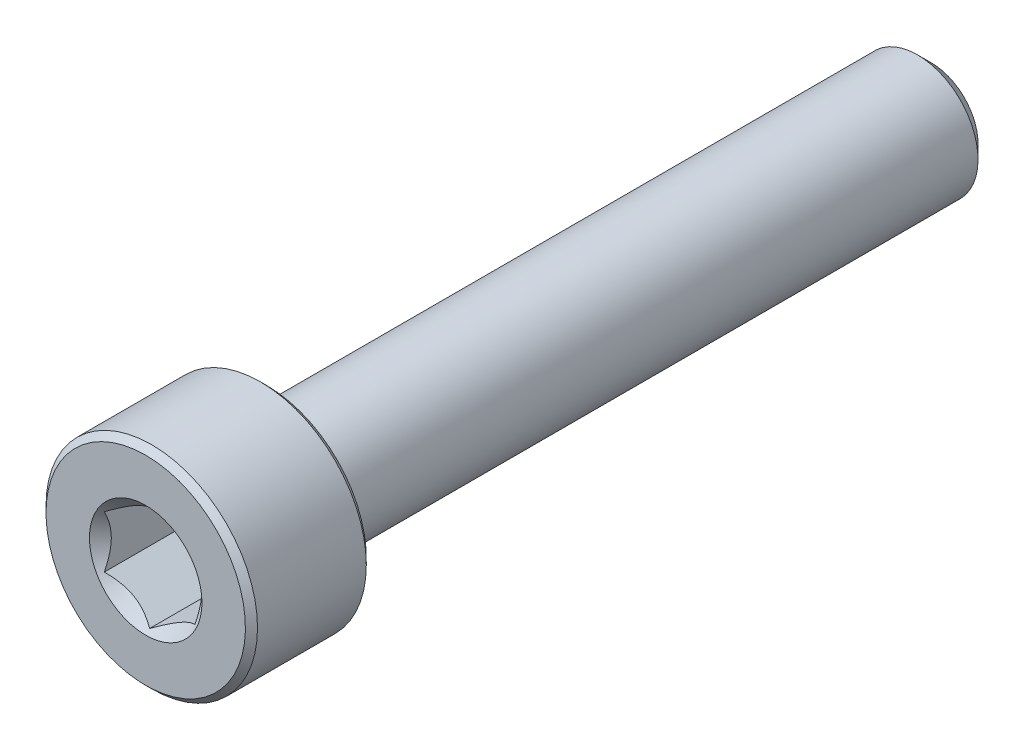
ISO-10303-21;
HEADER;
FILE_DESCRIPTION(('STEP AP214'),'2;1');
FILE_NAME('part.step','',(''),(''),'','','');
FILE_SCHEMA(('AUTOMOTIVE_DESIGN { 1 0 10303 214 1 1 1 1 }'));
ENDSEC;
DATA;
#1=APPLICATION_CONTEXT('core data for automotive mechanical design processes');
#2=APPLICATION_PROTOCOL_DEFINITION('international standard','automotive_design',2000,#1);
#3=PRODUCT_CONTEXT('',#1,'mechanical');
#4=PRODUCT('Part','Part','',(#3));
#5=PRODUCT_RELATED_PRODUCT_CATEGORY('part','',(#4));
#6=PRODUCT_DEFINITION_FORMATION('','',#4);
#7=PRODUCT_DEFINITION_CONTEXT('part definition',#1,'design');
#8=PRODUCT_DEFINITION('design','',#6,#7);
#9=PRODUCT_DEFINITION_SHAPE('','',#8);
#10=(LENGTH_UNIT() NAMED_UNIT(*) SI_UNIT(.MILLI.,.METRE.));
#11=(NAMED_UNIT(*) PLANE_ANGLE_UNIT() SI_UNIT($,.RADIAN.));
#12=(NAMED_UNIT(*) SI_UNIT($,.STERADIAN.) SOLID_ANGLE_UNIT());
#13=UNCERTAINTY_MEASURE_WITH_UNIT(LENGTH_MEASURE(1.E-05),#10,'distance_accuracy_value','');
#14=(GEOMETRIC_REPRESENTATION_CONTEXT(3) GLOBAL_UNCERTAINTY_ASSIGNED_CONTEXT((#13)) GLOBAL_UNIT_ASSIGNED_CONTEXT((#10,
#11,#12)) REPRESENTATION_CONTEXT('',''));
#15=CARTESIAN_POINT('',(0.,0.,0.));
#16=DIRECTION('',(0.,0.,1.));
#17=DIRECTION('',(1.,0.,0.));
#18=AXIS2_PLACEMENT_3D('',#15,#16,#17);
#19=CARTESIAN_POINT('',(0.,1.54533666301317,-13.));
#20=DIRECTION('',(0.,0.,-1.));
#21=DIRECTION('',(0.,1.,0.));
#22=AXIS2_PLACEMENT_3D('',#19,#20,#21);
#23=PLANE('',#22);
#24=CARTESIAN_POINT('',(0.,0.,-13.));
#25=DIRECTION('',(0.,0.,-1.));
#26=DIRECTION('',(0.,1.,0.));
#27=AXIS2_PLACEMENT_3D('',#24,#25,#26);
#28=CIRCLE('',#27,1.54533666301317);
#29=CARTESIAN_POINT('',(0.,1.54533666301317,-13.));
#30=VERTEX_POINT('',#29);
#31=EDGE_CURVE('E48',#30,#30,#28,.T.);
#32=ORIENTED_EDGE('',*,*,#31,.T.);
#33=EDGE_LOOP('',(#32));
#34=FACE_BOUND('',#33,.T.);
#35=ADVANCED_FACE('F35',(#34),#23,.T.);
#36=CARTESIAN_POINT('',(0.,0.,-13.));
#37=DIRECTION('',(0.,0.,1.));
#38=DIRECTION('',(0.,-1.,0.));
#39=AXIS2_PLACEMENT_3D('',#36,#37,#38);
#40=CONICAL_SURFACE('',#39,1.54533666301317,0.785398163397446);
#41=CARTESIAN_POINT('',(0.,0.,-12.5453366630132));
#42=DIRECTION('',(0.,0.,-1.));
#43=DIRECTION('',(0.,1.,0.));
#44=AXIS2_PLACEMENT_3D('',#41,#42,#43);
#45=CIRCLE('',#44,2.);
#46=CARTESIAN_POINT('',(0.,2.,-12.5453366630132));
#47=VERTEX_POINT('',#46);
#48=EDGE_CURVE('E151',#47,#47,#45,.T.);
#49=ORIENTED_EDGE('',*,*,#48,.T.);
#50=EDGE_LOOP('',(#49));
#51=FACE_BOUND('',#50,.T.);
#52=ORIENTED_EDGE('',*,*,#31,.F.);
#53=EDGE_LOOP('',(#52));
#54=FACE_BOUND('',#53,.T.);
#55=ADVANCED_FACE('F157',(#51,#54),#40,.T.);
#56=CARTESIAN_POINT('',(0.,0.,-13.));
#57=DIRECTION('',(0.,0.,-1.));
#58=DIRECTION('',(0.,1.,0.));
#59=AXIS2_PLACEMENT_3D('',#56,#57,#58);
#60=CYLINDRICAL_SURFACE('',#59,2.);
#61=CARTESIAN_POINT('',(0.,0.,8.8));
#62=DIRECTION('',(0.,0.,-1.));
#63=DIRECTION('',(0.,1.,0.));
#64=AXIS2_PLACEMENT_3D('',#61,#62,#63);
#65=CIRCLE('',#64,2.);
#66=CARTESIAN_POINT('',(0.,2.,8.8));
#67=VERTEX_POINT('',#66);
#68=EDGE_CURVE('E148',#67,#67,#65,.T.);
#69=ORIENTED_EDGE('',*,*,#68,.T.);
#70=EDGE_LOOP('',(#69));
#71=FACE_BOUND('',#70,.T.);
#72=ORIENTED_EDGE('',*,*,#48,.F.);
#73=EDGE_LOOP('',(#72));
#74=FACE_BOUND('',#73,.T.);
#75=ADVANCED_FACE('F159',(#71,#74),#60,.T.);
#76=CARTESIAN_POINT('',(0.,0.,8.8));
#77=DIRECTION('',(0.,0.,-1.));
#78=DIRECTION('',(0.,1.,0.));
#79=AXIS2_PLACEMENT_3D('',#76,#77,#78);
#80=TOROIDAL_SURFACE('',#79,2.2,0.200000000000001);
#81=CARTESIAN_POINT('',(0.,0.,9.));
#82=DIRECTION('',(0.,0.,-1.));
#83=DIRECTION('',(0.,1.,0.));
#84=AXIS2_PLACEMENT_3D('',#81,#82,#83);
#85=CIRCLE('',#84,2.2);
#86=CARTESIAN_POINT('',(0.,2.2,9.));
#87=VERTEX_POINT('',#86);
#88=EDGE_CURVE('E145',#87,#87,#85,.T.);
#89=ORIENTED_EDGE('',*,*,#88,.T.);
#90=EDGE_LOOP('',(#89));
#91=FACE_BOUND('',#90,.T.);
#92=ORIENTED_EDGE('',*,*,#68,.F.);
#93=EDGE_LOOP('',(#92));
#94=FACE_BOUND('',#93,.T.);
#95=ADVANCED_FACE('F165',(#91,#94),#80,.F.);
#96=CARTESIAN_POINT('',(0.,3.3,9.));
#97=DIRECTION('',(0.,0.,-1.));
#98=DIRECTION('',(0.,1.,0.));
#99=AXIS2_PLACEMENT_3D('',#96,#97,#98);
#100=PLANE('',#99);
#101=CARTESIAN_POINT('',(0.,0.,9.));
#102=DIRECTION('',(0.,0.,-1.));
#103=DIRECTION('',(0.,1.,0.));
#104=AXIS2_PLACEMENT_3D('',#101,#102,#103);
#105=CIRCLE('',#104,3.3);
#106=CARTESIAN_POINT('',(0.,3.3,9.));
#107=VERTEX_POINT('',#106);
#108=EDGE_CURVE('E142',#107,#107,#105,.T.);
#109=ORIENTED_EDGE('',*,*,#108,.T.);
#110=EDGE_LOOP('',(#109));
#111=FACE_BOUND('',#110,.T.);
#112=ORIENTED_EDGE('',*,*,#88,.F.);
#113=EDGE_LOOP('',(#112));
#114=FACE_BOUND('',#113,.T.);
#115=ADVANCED_FACE('F171',(#111,#114),#100,.T.);
#116=CARTESIAN_POINT('',(0.,0.,9.));
#117=DIRECTION('',(0.,0.,1.));
#118=DIRECTION('',(0.,-1.,0.));
#119=AXIS2_PLACEMENT_3D('',#116,#117,#118);
#120=CONICAL_SURFACE('',#119,3.3,0.785398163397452);
#121=CARTESIAN_POINT('',(0.,0.,9.2));
#122=DIRECTION('',(0.,0.,-1.));
#123=DIRECTION('',(0.,1.,0.));
#124=AXIS2_PLACEMENT_3D('',#121,#122,#123);
#125=CIRCLE('',#124,3.5);
#126=CARTESIAN_POINT('',(0.,3.5,9.2));
#127=VERTEX_POINT('',#126);
#128=EDGE_CURVE('E139',#127,#127,#125,.T.);
#129=ORIENTED_EDGE('',*,*,#128,.T.);
#130=EDGE_LOOP('',(#129));
#131=FACE_BOUND('',#130,.T.);
#132=ORIENTED_EDGE('',*,*,#108,.F.);
#133=EDGE_LOOP('',(#132));
#134=FACE_BOUND('',#133,.T.);
#135=ADVANCED_FACE('F175',(#131,#134),#120,.T.);
#136=CARTESIAN_POINT('',(0.,0.,-13.));
#137=DIRECTION('',(0.,0.,-1.));
#138=DIRECTION('',(0.,1.,0.));
#139=AXIS2_PLACEMENT_3D('',#136,#137,#138);
#140=CYLINDRICAL_SURFACE('',#139,3.5);
#141=CARTESIAN_POINT('',(0.,0.,12.8));
#142=DIRECTION('',(0.,0.,-1.));
#143=DIRECTION('',(0.,1.,0.));
#144=AXIS2_PLACEMENT_3D('',#141,#142,#143);
#145=CIRCLE('',#144,3.5);
#146=CARTESIAN_POINT('',(0.,3.5,12.8));
#147=VERTEX_POINT('',#146);
#148=EDGE_CURVE('E136',#147,#147,#145,.T.);
#149=ORIENTED_EDGE('',*,*,#148,.T.);
#150=EDGE_LOOP('',(#149));
#151=FACE_BOUND('',#150,.T.);
#152=ORIENTED_EDGE('',*,*,#128,.F.);
#153=EDGE_LOOP('',(#152));
#154=FACE_BOUND('',#153,.T.);
#155=ADVANCED_FACE('F179',(#151,#154),#140,.T.);
#156=CARTESIAN_POINT('',(0.,0.,12.8));
#157=DIRECTION('',(0.,0.,-1.));
#158=DIRECTION('',(0.,1.,0.));
#159=AXIS2_PLACEMENT_3D('',#156,#157,#158);
#160=CONICAL_SURFACE('',#159,3.5,0.785398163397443);
#161=CARTESIAN_POINT('',(0.,0.,13.));
#162=DIRECTION('',(0.,0.,-1.));
#163=DIRECTION('',(0.,1.,0.));
#164=AXIS2_PLACEMENT_3D('',#161,#162,#163);
#165=CIRCLE('',#164,3.3);
#166=CARTESIAN_POINT('',(0.,3.3,13.));
#167=VERTEX_POINT('',#166);
#168=EDGE_CURVE('E133',#167,#167,#165,.T.);
#169=ORIENTED_EDGE('',*,*,#168,.T.);
#170=EDGE_LOOP('',(#169));
#171=FACE_BOUND('',#170,.T.);
#172=ORIENTED_EDGE('',*,*,#148,.F.);
#173=EDGE_LOOP('',(#172));
#174=FACE_BOUND('',#173,.T.);
#175=ADVANCED_FACE('F183',(#171,#174),#160,.T.);
#176=CARTESIAN_POINT('',(0.,0.,13.));
#177=DIRECTION('',(0.,0.,1.));
#178=DIRECTION('',(0.,-1.,0.));
#179=AXIS2_PLACEMENT_3D('',#176,#177,#178);
#180=PLANE('',#179);
#181=CARTESIAN_POINT('',(0.,0.,13.));
#182=DIRECTION('',(0.,0.,1.));
#183=DIRECTION('',(1.,0.,0.));
#184=AXIS2_PLACEMENT_3D('',#181,#182,#183);
#185=CIRCLE('',#184,1.86195461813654);
#186=CARTESIAN_POINT('',(1.86195461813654,0.,13.));
#187=VERTEX_POINT('',#186);
#188=EDGE_CURVE('E107',#187,#187,#185,.T.);
#189=ORIENTED_EDGE('',*,*,#188,.F.);
#190=EDGE_LOOP('',(#189));
#191=FACE_BOUND('',#190,.T.);
#192=ORIENTED_EDGE('',*,*,#168,.F.);
#193=EDGE_LOOP('',(#192));
#194=FACE_BOUND('',#193,.T.);
#195=ADVANCED_FACE('F187',(#191,#194),#180,.T.);
#196=CARTESIAN_POINT('',(0.,0.,13.));
#197=DIRECTION('',(0.,0.,1.));
#198=DIRECTION('',(1.,0.,0.));
#199=AXIS2_PLACEMENT_3D('',#196,#197,#198);
#200=CONICAL_SURFACE('',#199,1.86195461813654,0.78539816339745);
#201=ORIENTED_EDGE('',*,*,#188,.T.);
#202=EDGE_LOOP('',(#201));
#203=FACE_BOUND('',#202,.T.);
#204=CARTESIAN_POINT('',(-0.000199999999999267,-1.73216627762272,12.8702116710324));
#205=CARTESIAN_POINT('',(0.051367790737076,-1.70239359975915,12.8404616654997));
#206=CARTESIAN_POINT('',(0.103797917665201,-1.67212305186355,12.8124586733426));
#207=CARTESIAN_POINT('',(0.210709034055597,-1.61039789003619,12.7611854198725));
#208=CARTESIAN_POINT('',(0.265200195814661,-1.57893740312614,12.7379436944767));
#209=CARTESIAN_POINT('',(0.375079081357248,-1.51549879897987,12.6981299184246));
#210=CARTESIAN_POINT('',(0.4304388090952,-1.4835368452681,12.6814577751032));
#211=CARTESIAN_POINT('',(0.542377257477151,-1.41890915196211,12.6557706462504));
#212=CARTESIAN_POINT('',(0.598952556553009,-1.38624538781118,12.6467364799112));
#213=CARTESIAN_POINT('',(0.696455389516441,-1.329952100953,12.6385852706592));
#214=CARTESIAN_POINT('',(0.737256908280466,-1.30639533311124,12.6373784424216));
#215=CARTESIAN_POINT('',(0.818787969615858,-1.25932335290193,12.6394102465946));
#216=CARTESIAN_POINT('',(0.85951749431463,-1.23580815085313,12.6426498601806));
#217=CARTESIAN_POINT('',(0.940584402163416,-1.18900414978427,12.6533881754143));
#218=CARTESIAN_POINT('',(0.980921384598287,-1.1657155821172,12.6608908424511));
#219=CARTESIAN_POINT('',(1.06091833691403,-1.11952932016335,12.6797478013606));
#220=CARTESIAN_POINT('',(1.10057800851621,-1.09663179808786,12.6911037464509));
#221=CARTESIAN_POINT('',(1.20216313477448,-1.03798159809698,12.724817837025));
#222=CARTESIAN_POINT('',(1.26345855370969,-1.00259267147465,12.7497180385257));
#223=CARTESIAN_POINT('',(1.35358562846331,-0.950557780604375,12.7917528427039));
#224=CARTESIAN_POINT('',(1.38328513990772,-0.933410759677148,12.8065213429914));
#225=CARTESIAN_POINT('',(1.44213790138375,-0.899432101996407,12.8374067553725));
#226=CARTESIAN_POINT('',(1.47129140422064,-0.88260031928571,12.853523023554));
#227=CARTESIAN_POINT('',(1.5002,-0.865909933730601,12.8702116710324));
#228=B_SPLINE_CURVE_WITH_KNOTS('',3,(#204,#205,#206,#207,#208,#209,#210,#211,#212,#213,#214,
#215,#216,#217,#218,#219,#220,#221,#222,#223,#224,#225,#226,#227),.UNSPECIFIED.,.F.,.F.,(4,2,2,
2,2,2,2,2,2,2,2,4),(0.,0.199829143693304,0.400822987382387,0.59862372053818,0.795926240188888,
0.93711306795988,1.07833105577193,1.21968061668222,1.36109089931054,1.58570969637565,
1.69770705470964,1.80965120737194),.UNSPECIFIED.);
#229=CARTESIAN_POINT('',(0.,-1.73205080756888,12.8700961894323));
#230=VERTEX_POINT('',#229);
#231=CARTESIAN_POINT('',(1.5,-0.866025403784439,12.8700961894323));
#232=VERTEX_POINT('',#231);
#233=EDGE_CURVE('E12',#230,#232,#228,.T.);
#234=ORIENTED_EDGE('',*,*,#233,.F.);
#235=CARTESIAN_POINT('',(-1.5002,-0.865909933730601,12.8702116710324));
#236=CARTESIAN_POINT('',(-1.44863220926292,-0.895682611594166,12.8404616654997));
#237=CARTESIAN_POINT('',(-1.3962020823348,-0.925953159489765,12.8124586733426));
#238=CARTESIAN_POINT('',(-1.2892909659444,-0.987678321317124,12.7611854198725));
#239=CARTESIAN_POINT('',(-1.23479980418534,-1.01913880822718,12.7379436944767));
#240=CARTESIAN_POINT('',(-1.12492091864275,-1.08257741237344,12.6981299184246));
#241=CARTESIAN_POINT('',(-1.0695611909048,-1.11453936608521,12.6814577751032));
#242=CARTESIAN_POINT('',(-0.957622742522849,-1.1791670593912,12.6557706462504));
#243=CARTESIAN_POINT('',(-0.901047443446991,-1.21183082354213,12.6467364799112));
#244=CARTESIAN_POINT('',(-0.803544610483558,-1.26812411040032,12.6385852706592));
#245=CARTESIAN_POINT('',(-0.762743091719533,-1.29168087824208,12.6373784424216));
#246=CARTESIAN_POINT('',(-0.681212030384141,-1.33875285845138,12.6394102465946));
#247=CARTESIAN_POINT('',(-0.640482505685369,-1.36226806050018,12.6426498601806));
#248=CARTESIAN_POINT('',(-0.559415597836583,-1.40907206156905,12.6533881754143));
#249=CARTESIAN_POINT('',(-0.519078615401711,-1.43236062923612,12.6608908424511));
#250=CARTESIAN_POINT('',(-0.439081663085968,-1.47854689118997,12.6797478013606));
#251=CARTESIAN_POINT('',(-0.399421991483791,-1.50144441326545,12.6911037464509));
#252=CARTESIAN_POINT('',(-0.297836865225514,-1.56009461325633,12.724817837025));
#253=CARTESIAN_POINT('',(-0.23654144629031,-1.59548353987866,12.7497180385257));
#254=CARTESIAN_POINT('',(-0.146414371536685,-1.64751843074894,12.7917528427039));
#255=CARTESIAN_POINT('',(-0.116714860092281,-1.66466545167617,12.8065213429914));
#256=CARTESIAN_POINT('',(-0.0578620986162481,-1.69864410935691,12.8374067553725));
#257=CARTESIAN_POINT('',(-0.0287085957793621,-1.71547589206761,12.853523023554));
#258=CARTESIAN_POINT('',(0.000200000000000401,-1.73216627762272,12.8702116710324));
#259=B_SPLINE_CURVE_WITH_KNOTS('',3,(#235,#236,#237,#238,#239,#240,#241,#242,#243,#244,#245,
#246,#247,#248,#249,#250,#251,#252,#253,#254,#255,#256,#257,#258),.UNSPECIFIED.,.F.,.F.,(4,2,2,
2,2,2,2,2,2,2,2,4),(0.,0.199829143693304,0.400822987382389,0.598623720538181,0.79592624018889,
0.937113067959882,1.07833105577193,1.21968061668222,1.36109089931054,1.58570969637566,
1.69770705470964,1.80965120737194),.UNSPECIFIED.);
#260=CARTESIAN_POINT('',(-1.5,-0.866025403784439,12.8700961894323));
#261=VERTEX_POINT('',#260);
#262=EDGE_CURVE('E93',#261,#230,#259,.T.);
#263=ORIENTED_EDGE('',*,*,#262,.F.);
#264=CARTESIAN_POINT('',(-1.5,-1.81798631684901,13.4949658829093));
#265=CARTESIAN_POINT('',(-1.5,-1.77410479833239,13.461123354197));
#266=CARTESIAN_POINT('',(-1.5,-1.72998897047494,13.427585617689));
#267=CARTESIAN_POINT('',(-1.5,-1.64119029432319,13.3612481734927));
#268=CARTESIAN_POINT('',(-1.5,-1.59650731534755,13.328448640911));
#269=CARTESIAN_POINT('',(-1.5,-1.460806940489,13.2308819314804));
#270=CARTESIAN_POINT('',(-1.5,-1.36880251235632,13.1674654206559));
#271=CARTESIAN_POINT('',(-1.5,-1.17526237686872,13.0421023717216));
#272=CARTESIAN_POINT('',(-1.5,-1.07349393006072,12.9805114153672));
#273=CARTESIAN_POINT('',(-1.5,-0.864764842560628,12.8672522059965));
#274=CARTESIAN_POINT('',(-1.5,-0.757823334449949,12.8155504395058));
#275=CARTESIAN_POINT('',(-1.5,-0.598146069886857,12.7522731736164));
#276=CARTESIAN_POINT('',(-1.5,-0.547969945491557,12.7342740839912));
#277=CARTESIAN_POINT('',(-1.5,-0.446326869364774,12.7022954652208));
#278=CARTESIAN_POINT('',(-1.5,-0.394859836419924,12.6883161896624));
#279=CARTESIAN_POINT('',(-1.5,-0.291848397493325,12.6653656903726));
#280=CARTESIAN_POINT('',(-1.5,-0.240324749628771,12.6563028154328));
#281=CARTESIAN_POINT('',(-1.5,-0.13662544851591,12.6433771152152));
#282=CARTESIAN_POINT('',(-1.5,-0.0844499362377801,12.6395131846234));
#283=CARTESIAN_POINT('',(-1.5,0.0176806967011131,12.6373196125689));
#284=CARTESIAN_POINT('',(-1.5,0.0676307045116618,12.6387500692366));
#285=CARTESIAN_POINT('',(-1.5,0.16714547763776,12.6465133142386));
#286=CARTESIAN_POINT('',(-1.5,0.216710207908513,12.6528465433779));
#287=CARTESIAN_POINT('',(-1.5,0.315937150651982,12.6701627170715));
#288=CARTESIAN_POINT('',(-1.5,0.365584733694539,12.6812281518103));
#289=CARTESIAN_POINT('',(-1.5,0.46378160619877,12.7073934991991));
#290=CARTESIAN_POINT('',(-1.5,0.512330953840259,12.7224931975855));
#291=CARTESIAN_POINT('',(-1.5,0.661313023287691,12.7746138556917));
#292=CARTESIAN_POINT('',(-1.5,0.759720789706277,12.8174049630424));
#293=CARTESIAN_POINT('',(-1.5,0.95194266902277,12.9126388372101));
#294=CARTESIAN_POINT('',(-1.5,1.04573912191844,12.9651155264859));
#295=CARTESIAN_POINT('',(-1.5,1.22504153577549,13.0734783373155));
#296=CARTESIAN_POINT('',(-1.5,1.3107282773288,13.1290691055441));
#297=CARTESIAN_POINT('',(-1.5,1.43696960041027,13.2150504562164));
#298=CARTESIAN_POINT('',(-1.5,1.47850725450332,13.2440226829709));
#299=CARTESIAN_POINT('',(-1.5,1.56101250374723,13.3027448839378));
#300=CARTESIAN_POINT('',(-1.5,1.60198025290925,13.3324946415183));
#301=CARTESIAN_POINT('',(-1.5,1.64271029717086,13.362567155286));
#302=B_SPLINE_CURVE_WITH_KNOTS('',3,(#264,#265,#266,#267,#268,#269,#270,#271,#272,#273,#274,
#275,#276,#277,#278,#279,#280,#281,#282,#283,#284,#285,#286,#287,#288,#289,#290,#291,#292,#293,
#294,#295,#296,#297,#298,#299,#300,#301),.UNSPECIFIED.,.F.,.F.,(4,2,2,2,2,2,2,2,2,2,2,2,2,2,2,2,
2,2,4),(0.,0.166243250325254,0.332525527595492,0.667617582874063,1.02421660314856,
1.37958485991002,1.53937185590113,1.69916892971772,1.85587466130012,2.01254707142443,
2.16220898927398,2.31188436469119,2.46428258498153,2.61667271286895,2.93766301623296,
3.25979964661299,3.56606529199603,3.71798989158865,3.86987260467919),.UNSPECIFIED.);
#303=CARTESIAN_POINT('',(-1.5,0.866025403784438,12.8700961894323));
#304=VERTEX_POINT('',#303);
#305=EDGE_CURVE('E106',#304,#261,#302,.F.);
#306=ORIENTED_EDGE('',*,*,#305,.F.);
#307=CARTESIAN_POINT('',(0.000199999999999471,1.73216627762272,12.8702116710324));
#308=CARTESIAN_POINT('',(-0.0513677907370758,1.70239359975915,12.8404616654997));
#309=CARTESIAN_POINT('',(-0.103797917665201,1.67212305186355,12.8124586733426));
#310=CARTESIAN_POINT('',(-0.210709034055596,1.61039789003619,12.7611854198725));
#311=CARTESIAN_POINT('',(-0.265200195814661,1.57893740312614,12.7379436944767));
#312=CARTESIAN_POINT('',(-0.375079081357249,1.51549879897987,12.6981299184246));
#313=CARTESIAN_POINT('',(-0.4304388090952,1.4835368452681,12.6814577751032));
#314=CARTESIAN_POINT('',(-0.54237725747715,1.41890915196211,12.6557706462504));
#315=CARTESIAN_POINT('',(-0.598952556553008,1.38624538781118,12.6467364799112));
#316=CARTESIAN_POINT('',(-0.69645538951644,1.329952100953,12.6385852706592));
#317=CARTESIAN_POINT('',(-0.737256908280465,1.30639533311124,12.6373784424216));
#318=CARTESIAN_POINT('',(-0.818787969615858,1.25932335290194,12.6394102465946));
#319=CARTESIAN_POINT('',(-0.859517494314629,1.23580815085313,12.6426498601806));
#320=CARTESIAN_POINT('',(-0.940584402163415,1.18900414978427,12.6533881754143));
#321=CARTESIAN_POINT('',(-0.980921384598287,1.1657155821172,12.6608908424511));
#322=CARTESIAN_POINT('',(-1.06091833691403,1.11952932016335,12.6797478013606));
#323=CARTESIAN_POINT('',(-1.10057800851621,1.09663179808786,12.6911037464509));
#324=CARTESIAN_POINT('',(-1.20216313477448,1.03798159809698,12.724817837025));
#325=CARTESIAN_POINT('',(-1.26345855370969,1.00259267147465,12.7497180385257));
#326=CARTESIAN_POINT('',(-1.35358562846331,0.950557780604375,12.7917528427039));
#327=CARTESIAN_POINT('',(-1.38328513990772,0.933410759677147,12.8065213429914));
#328=CARTESIAN_POINT('',(-1.44213790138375,0.899432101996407,12.8374067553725));
#329=CARTESIAN_POINT('',(-1.47129140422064,0.88260031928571,12.853523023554));
#330=CARTESIAN_POINT('',(-1.5002,0.8659099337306,12.8702116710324));
#331=B_SPLINE_CURVE_WITH_KNOTS('',3,(#307,#308,#309,#310,#311,#312,#313,#314,#315,#316,#317,
#318,#319,#320,#321,#322,#323,#324,#325,#326,#327,#328,#329,#330),.UNSPECIFIED.,.F.,.F.,(4,2,2,
2,2,2,2,2,2,2,2,4),(0.,0.199829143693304,0.400822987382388,0.59862372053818,0.795926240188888,
0.93711306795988,1.07833105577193,1.21968061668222,1.36109089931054,1.58570969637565,
1.69770705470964,1.80965120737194),.UNSPECIFIED.);
#332=CARTESIAN_POINT('',(0.,1.73205080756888,12.8700961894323));
#333=VERTEX_POINT('',#332);
#334=EDGE_CURVE('E237',#333,#304,#331,.T.);
#335=ORIENTED_EDGE('',*,*,#334,.F.);
#336=CARTESIAN_POINT('',(1.5002,0.865909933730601,12.8702116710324));
#337=CARTESIAN_POINT('',(1.44863220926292,0.895682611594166,12.8404616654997));
#338=CARTESIAN_POINT('',(1.3962020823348,0.925953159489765,12.8124586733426));
#339=CARTESIAN_POINT('',(1.2892909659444,0.987678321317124,12.7611854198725));
#340=CARTESIAN_POINT('',(1.23479980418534,1.01913880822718,12.7379436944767));
#341=CARTESIAN_POINT('',(1.12492091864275,1.08257741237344,12.6981299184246));
#342=CARTESIAN_POINT('',(1.0695611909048,1.11453936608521,12.6814577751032));
#343=CARTESIAN_POINT('',(0.957622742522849,1.1791670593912,12.6557706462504));
#344=CARTESIAN_POINT('',(0.901047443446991,1.21183082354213,12.6467364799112));
#345=CARTESIAN_POINT('',(0.803544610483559,1.26812411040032,12.6385852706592));
#346=CARTESIAN_POINT('',(0.762743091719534,1.29168087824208,12.6373784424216));
#347=CARTESIAN_POINT('',(0.681212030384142,1.33875285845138,12.6394102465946));
#348=CARTESIAN_POINT('',(0.64048250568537,1.36226806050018,12.6426498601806));
#349=CARTESIAN_POINT('',(0.559415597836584,1.40907206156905,12.6533881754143));
#350=CARTESIAN_POINT('',(0.519078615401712,1.43236062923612,12.6608908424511));
#351=CARTESIAN_POINT('',(0.439081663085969,1.47854689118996,12.6797478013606));
#352=CARTESIAN_POINT('',(0.399421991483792,1.50144441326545,12.6911037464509));
#353=CARTESIAN_POINT('',(0.297836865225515,1.56009461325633,12.724817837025));
#354=CARTESIAN_POINT('',(0.236541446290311,1.59548353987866,12.7497180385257));
#355=CARTESIAN_POINT('',(0.146414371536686,1.64751843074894,12.7917528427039));
#356=CARTESIAN_POINT('',(0.116714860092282,1.66466545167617,12.8065213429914));
#357=CARTESIAN_POINT('',(0.0578620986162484,1.69864410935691,12.8374067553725));
#358=CARTESIAN_POINT('',(0.0287085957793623,1.71547589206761,12.853523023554));
#359=CARTESIAN_POINT('',(-0.000200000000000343,1.73216627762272,12.8702116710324));
#360=B_SPLINE_CURVE_WITH_KNOTS('',3,(#336,#337,#338,#339,#340,#341,#342,#343,#344,#345,#346,
#347,#348,#349,#350,#351,#352,#353,#354,#355,#356,#357,#358,#359),.UNSPECIFIED.,.F.,.F.,(4,2,2,
2,2,2,2,2,2,2,2,4),(0.,0.199829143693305,0.400822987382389,0.598623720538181,0.795926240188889,
0.937113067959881,1.07833105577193,1.21968061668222,1.36109089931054,1.58570969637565,
1.69770705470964,1.80965120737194),.UNSPECIFIED.);
#361=CARTESIAN_POINT('',(1.5,0.866025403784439,12.8700961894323));
#362=VERTEX_POINT('',#361);
#363=EDGE_CURVE('E210',#362,#333,#360,.T.);
#364=ORIENTED_EDGE('',*,*,#363,.F.);
#365=CARTESIAN_POINT('',(1.5,-1.81798631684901,13.4949658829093));
#366=CARTESIAN_POINT('',(1.5,-1.77410479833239,13.461123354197));
#367=CARTESIAN_POINT('',(1.5,-1.72998897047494,13.427585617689));
#368=CARTESIAN_POINT('',(1.5,-1.64119029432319,13.3612481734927));
#369=CARTESIAN_POINT('',(1.5,-1.59650731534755,13.328448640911));
#370=CARTESIAN_POINT('',(1.5,-1.460806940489,13.2308819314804));
#371=CARTESIAN_POINT('',(1.5,-1.36880251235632,13.1674654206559));
#372=CARTESIAN_POINT('',(1.5,-1.17526237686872,13.0421023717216));
#373=CARTESIAN_POINT('',(1.5,-1.07349393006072,12.9805114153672));
#374=CARTESIAN_POINT('',(1.5,-0.864764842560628,12.8672522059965));
#375=CARTESIAN_POINT('',(1.5,-0.757823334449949,12.8155504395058));
#376=CARTESIAN_POINT('',(1.5,-0.598146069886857,12.7522731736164));
#377=CARTESIAN_POINT('',(1.5,-0.547969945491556,12.7342740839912));
#378=CARTESIAN_POINT('',(1.5,-0.446326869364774,12.7022954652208));
#379=CARTESIAN_POINT('',(1.5,-0.394859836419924,12.6883161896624));
#380=CARTESIAN_POINT('',(1.5,-0.291848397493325,12.6653656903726));
#381=CARTESIAN_POINT('',(1.5,-0.240324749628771,12.6563028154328));
#382=CARTESIAN_POINT('',(1.5,-0.13662544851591,12.6433771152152));
#383=CARTESIAN_POINT('',(1.5,-0.0844499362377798,12.6395131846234));
#384=CARTESIAN_POINT('',(1.5,0.0176806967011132,12.6373196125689));
#385=CARTESIAN_POINT('',(1.5,0.0676307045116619,12.6387500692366));
#386=CARTESIAN_POINT('',(1.5,0.16714547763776,12.6465133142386));
#387=CARTESIAN_POINT('',(1.5,0.216710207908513,12.6528465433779));
#388=CARTESIAN_POINT('',(1.5,0.315937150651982,12.6701627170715));
#389=CARTESIAN_POINT('',(1.5,0.365584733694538,12.6812281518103));
#390=CARTESIAN_POINT('',(1.5,0.46378160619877,12.7073934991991));
#391=CARTESIAN_POINT('',(1.5,0.512330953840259,12.7224931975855));
#392=CARTESIAN_POINT('',(1.5,0.661313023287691,12.7746138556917));
#393=CARTESIAN_POINT('',(1.5,0.759720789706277,12.8174049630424));
#394=CARTESIAN_POINT('',(1.5,0.95194266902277,12.9126388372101));
#395=CARTESIAN_POINT('',(1.5,1.04573912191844,12.9651155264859));
#396=CARTESIAN_POINT('',(1.5,1.22504153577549,13.0734783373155));
#397=CARTESIAN_POINT('',(1.5,1.3107282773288,13.1290691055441));
#398=CARTESIAN_POINT('',(1.5,1.43696960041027,13.2150504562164));
#399=CARTESIAN_POINT('',(1.5,1.47850725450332,13.2440226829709));
#400=CARTESIAN_POINT('',(1.5,1.56101250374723,13.3027448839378));
#401=CARTESIAN_POINT('',(1.5,1.60198025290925,13.3324946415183));
#402=CARTESIAN_POINT('',(1.5,1.64271029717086,13.362567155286));
#403=B_SPLINE_CURVE_WITH_KNOTS('',3,(#365,#366,#367,#368,#369,#370,#371,#372,#373,#374,#375,
#376,#377,#378,#379,#380,#381,#382,#383,#384,#385,#386,#387,#388,#389,#390,#391,#392,#393,#394,
#395,#396,#397,#398,#399,#400,#401,#402),.UNSPECIFIED.,.F.,.F.,(4,2,2,2,2,2,2,2,2,2,2,2,2,2,2,2,
2,2,4),(0.,0.166243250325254,0.332525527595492,0.667617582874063,1.02421660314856,
1.37958485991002,1.53937185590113,1.69916892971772,1.85587466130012,2.01254707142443,
2.16220898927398,2.31188436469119,2.46428258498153,2.61667271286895,2.93766301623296,
3.25979964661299,3.56606529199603,3.71798989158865,3.86987260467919),.UNSPECIFIED.);
#404=EDGE_CURVE('E55',#232,#362,#403,.T.);
#405=ORIENTED_EDGE('',*,*,#404,.F.);
#406=EDGE_LOOP('',(#234,#263,#306,#335,#364,#405));
#407=FACE_BOUND('',#406,.T.);
#408=ADVANCED_FACE('F92',(#203,#407),#200,.F.);
#409=CARTESIAN_POINT('',(0.,3.3,10.));
#410=DIRECTION('',(0.,0.,-1.));
#411=DIRECTION('',(0.,1.,0.));
#412=AXIS2_PLACEMENT_3D('',#409,#410,#411);
#413=PLANE('',#412);
#414=DIRECTION('',(0.866025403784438,0.5,0.));
#415=VECTOR('',#414,1.);
#416=CARTESIAN_POINT('',(0.,-1.73205080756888,10.));
#417=LINE('',#416,#415);
#418=CARTESIAN_POINT('',(0.,-1.73205080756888,10.));
#419=VERTEX_POINT('',#418);
#420=CARTESIAN_POINT('',(1.5,-0.866025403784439,10.));
#421=VERTEX_POINT('',#420);
#422=EDGE_CURVE('E110',#419,#421,#417,.T.);
#423=ORIENTED_EDGE('',*,*,#422,.T.);
#424=DIRECTION('',(0.,1.,0.));
#425=VECTOR('',#424,1.);
#426=CARTESIAN_POINT('',(1.5,-0.866025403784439,10.));
#427=LINE('',#426,#425);
#428=CARTESIAN_POINT('',(1.5,0.866025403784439,10.));
#429=VERTEX_POINT('',#428);
#430=EDGE_CURVE('E62',#421,#429,#427,.T.);
#431=ORIENTED_EDGE('',*,*,#430,.T.);
#432=DIRECTION('',(-0.866025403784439,0.5,0.));
#433=VECTOR('',#432,1.);
#434=CARTESIAN_POINT('',(1.5,0.866025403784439,10.));
#435=LINE('',#434,#433);
#436=CARTESIAN_POINT('',(0.,1.73205080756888,10.));
#437=VERTEX_POINT('',#436);
#438=EDGE_CURVE('E118',#429,#437,#435,.T.);
#439=ORIENTED_EDGE('',*,*,#438,.T.);
#440=DIRECTION('',(-0.866025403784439,-0.5,0.));
#441=VECTOR('',#440,1.);
#442=CARTESIAN_POINT('',(0.,1.73205080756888,10.));
#443=LINE('',#442,#441);
#444=CARTESIAN_POINT('',(-1.5,0.866025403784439,10.));
#445=VERTEX_POINT('',#444);
#446=EDGE_CURVE('E125',#437,#445,#443,.T.);
#447=ORIENTED_EDGE('',*,*,#446,.T.);
#448=DIRECTION('',(0.,-1.,0.));
#449=VECTOR('',#448,1.);
#450=CARTESIAN_POINT('',(-1.5,0.866025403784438,10.));
#451=LINE('',#450,#449);
#452=CARTESIAN_POINT('',(-1.5,-0.866025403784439,10.));
#453=VERTEX_POINT('',#452);
#454=EDGE_CURVE('E121',#445,#453,#451,.T.);
#455=ORIENTED_EDGE('',*,*,#454,.T.);
#456=DIRECTION('',(0.866025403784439,-0.5,0.));
#457=VECTOR('',#456,1.);
#458=CARTESIAN_POINT('',(-1.5,-0.866025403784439,10.));
#459=LINE('',#458,#457);
#460=EDGE_CURVE('E111',#453,#419,#459,.T.);
#461=ORIENTED_EDGE('',*,*,#460,.T.);
#462=EDGE_LOOP('',(#423,#431,#439,#447,#455,#461));
#463=FACE_BOUND('',#462,.T.);
#464=ADVANCED_FACE('F192',(#463),#413,.F.);
#465=CARTESIAN_POINT('',(0.,-1.73205080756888,4.41742430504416));
#466=DIRECTION('',(0.5,-0.866025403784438,0.));
#467=DIRECTION('',(0.866025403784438,0.5,0.));
#468=AXIS2_PLACEMENT_3D('',#465,#466,#467);
#469=PLANE('',#468);
#470=DIRECTION('',(0.,0.,1.));
#471=VECTOR('',#470,1.);
#472=CARTESIAN_POINT('',(0.,-1.73205080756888,4.41742430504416));
#473=LINE('',#472,#471);
#474=EDGE_CURVE('E102',#419,#230,#473,.T.);
#475=ORIENTED_EDGE('',*,*,#474,.T.);
#476=ORIENTED_EDGE('',*,*,#233,.T.);
#477=DIRECTION('',(0.,0.,1.));
#478=VECTOR('',#477,1.);
#479=CARTESIAN_POINT('',(1.5,-0.866025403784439,4.41742430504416));
#480=LINE('',#479,#478);
#481=EDGE_CURVE('E113',#421,#232,#480,.T.);
#482=ORIENTED_EDGE('',*,*,#481,.F.);
#483=ORIENTED_EDGE('',*,*,#422,.F.);
#484=EDGE_LOOP('',(#475,#476,#482,#483));
#485=FACE_BOUND('',#484,.T.);
#486=ADVANCED_FACE('F109',(#485),#469,.F.);
#487=CARTESIAN_POINT('',(-1.5,-0.866025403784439,4.41742430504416));
#488=DIRECTION('',(-0.5,-0.866025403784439,0.));
#489=DIRECTION('',(0.866025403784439,-0.5,0.));
#490=AXIS2_PLACEMENT_3D('',#487,#488,#489);
#491=PLANE('',#490);
#492=DIRECTION('',(0.,0.,1.));
#493=VECTOR('',#492,1.);
#494=CARTESIAN_POINT('',(-1.5,-0.866025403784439,4.41742430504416));
#495=LINE('',#494,#493);
#496=EDGE_CURVE('E105',#453,#261,#495,.T.);
#497=ORIENTED_EDGE('',*,*,#496,.T.);
#498=ORIENTED_EDGE('',*,*,#262,.T.);
#499=ORIENTED_EDGE('',*,*,#474,.F.);
#500=ORIENTED_EDGE('',*,*,#460,.F.);
#501=EDGE_LOOP('',(#497,#498,#499,#500));
#502=FACE_BOUND('',#501,.T.);
#503=ADVANCED_FACE('F101',(#502),#491,.F.);
#504=CARTESIAN_POINT('',(-1.5,0.866025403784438,4.41742430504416));
#505=DIRECTION('',(-1.,0.,0.));
#506=DIRECTION('',(0.,0.,1.));
#507=AXIS2_PLACEMENT_3D('',#504,#505,#506);
#508=PLANE('',#507);
#509=DIRECTION('',(0.,0.,1.));
#510=VECTOR('',#509,1.);
#511=CARTESIAN_POINT('',(-1.5,0.866025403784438,4.41742430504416));
#512=LINE('',#511,#510);
#513=EDGE_CURVE('E122',#445,#304,#512,.T.);
#514=ORIENTED_EDGE('',*,*,#513,.T.);
#515=ORIENTED_EDGE('',*,*,#305,.T.);
#516=ORIENTED_EDGE('',*,*,#496,.F.);
#517=ORIENTED_EDGE('',*,*,#454,.F.);
#518=EDGE_LOOP('',(#514,#515,#516,#517));
#519=FACE_BOUND('',#518,.T.);
#520=ADVANCED_FACE('F246',(#519),#508,.F.);
#521=CARTESIAN_POINT('',(0.,1.73205080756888,4.41742430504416));
#522=DIRECTION('',(-0.5,0.866025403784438,0.));
#523=DIRECTION('',(-0.866025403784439,-0.5,0.));
#524=AXIS2_PLACEMENT_3D('',#521,#522,#523);
#525=PLANE('',#524);
#526=DIRECTION('',(0.,0.,1.));
#527=VECTOR('',#526,1.);
#528=CARTESIAN_POINT('',(0.,1.73205080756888,4.41742430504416));
#529=LINE('',#528,#527);
#530=EDGE_CURVE('E126',#437,#333,#529,.T.);
#531=ORIENTED_EDGE('',*,*,#530,.T.);
#532=ORIENTED_EDGE('',*,*,#334,.T.);
#533=ORIENTED_EDGE('',*,*,#513,.F.);
#534=ORIENTED_EDGE('',*,*,#446,.F.);
#535=EDGE_LOOP('',(#531,#532,#533,#534));
#536=FACE_BOUND('',#535,.T.);
#537=ADVANCED_FACE('F243',(#536),#525,.F.);
#538=CARTESIAN_POINT('',(1.5,0.866025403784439,4.41742430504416));
#539=DIRECTION('',(0.5,0.866025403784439,0.));
#540=DIRECTION('',(-0.866025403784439,0.5,0.));
#541=AXIS2_PLACEMENT_3D('',#538,#539,#540);
#542=PLANE('',#541);
#543=DIRECTION('',(0.,0.,1.));
#544=VECTOR('',#543,1.);
#545=CARTESIAN_POINT('',(1.5,0.866025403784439,4.41742430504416));
#546=LINE('',#545,#544);
#547=EDGE_CURVE('E129',#429,#362,#546,.T.);
#548=ORIENTED_EDGE('',*,*,#547,.T.);
#549=ORIENTED_EDGE('',*,*,#363,.T.);
#550=ORIENTED_EDGE('',*,*,#530,.F.);
#551=ORIENTED_EDGE('',*,*,#438,.F.);
#552=EDGE_LOOP('',(#548,#549,#550,#551));
#553=FACE_BOUND('',#552,.T.);
#554=ADVANCED_FACE('F200',(#553),#542,.F.);
#555=CARTESIAN_POINT('',(1.5,-0.866025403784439,4.41742430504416));
#556=DIRECTION('',(1.,0.,0.));
#557=DIRECTION('',(0.,0.,-1.));
#558=AXIS2_PLACEMENT_3D('',#555,#556,#557);
#559=PLANE('',#558);
#560=ORIENTED_EDGE('',*,*,#481,.T.);
#561=ORIENTED_EDGE('',*,*,#404,.T.);
#562=ORIENTED_EDGE('',*,*,#547,.F.);
#563=ORIENTED_EDGE('',*,*,#430,.F.);
#564=EDGE_LOOP('',(#560,#561,#562,#563));
#565=FACE_BOUND('',#564,.T.);
#566=ADVANCED_FACE('F196',(#565),#559,.F.);
#567=CLOSED_SHELL('',(#35,#55,#75,#95,#115,#135,#155,#175,#195,#408,#464,#486,#503,#520,#537,
#554,#566));
#568=MANIFOLD_SOLID_BREP('B2',#567);
#569=ADVANCED_BREP_SHAPE_REPRESENTATION('',(#18,#568),#14);
#570=SHAPE_DEFINITION_REPRESENTATION(#9,#569);
ENDSEC;
END-ISO-10303-21;
